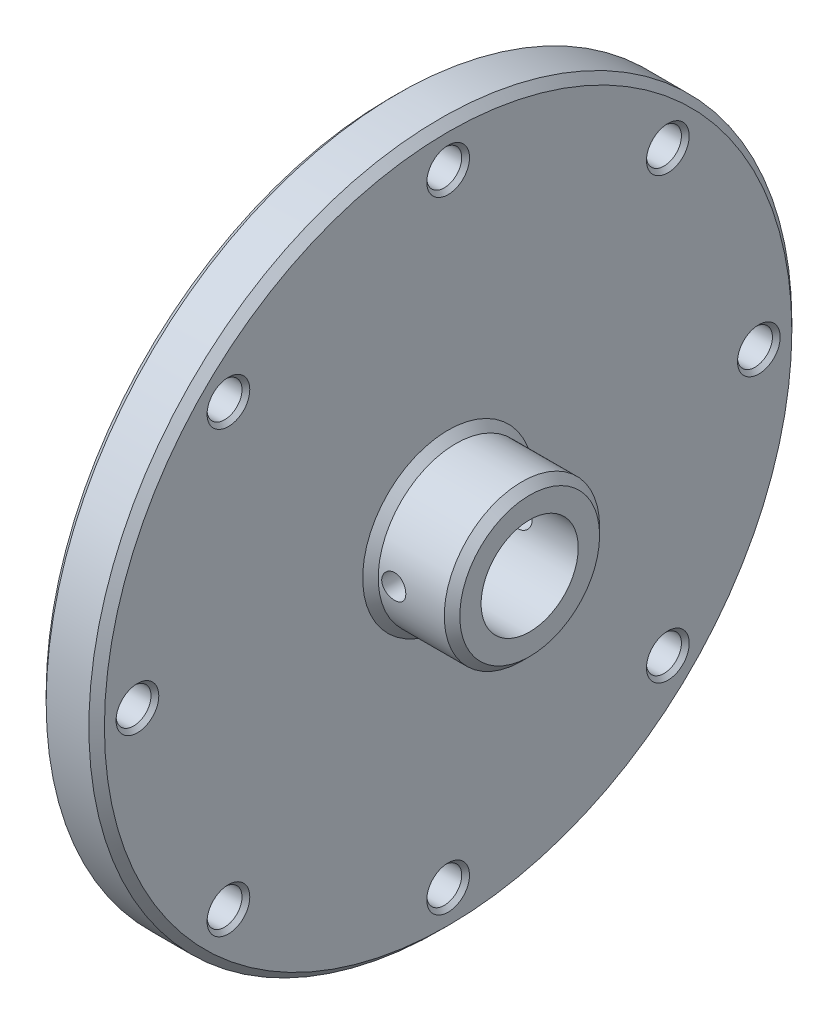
from build123d import *

# Parameters (mm, degrees)
CHANFREIN1_SIZE                           = 2
ENL_V_MAT_EXTRU_1_DEPTH                   = 132.121127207
ENL_V_MAT_EXTRU_1_DEPTH_BACK              = 132.121127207
ESQUISSE2_R                               = 3.1
ESQUISSE3_R                               = 4.5
ENL_V_MAT_EXTRU_2_DEPTH                   = 130.697725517
CHANFREIN2_SIZE                           = 1
R_P_TITION_CIRCULAIRE1_COUNT              = 8
CHANFREIN2_OF_R_P_TITION_CIRCULAIRE1_SIZE = 1


with BuildPart() as part:
    # Esquisse1 → R_volution1 (revolve)
    with BuildSketch(Plane.XY, mode=Mode.PRIVATE) as r_volution1_sk:
        Polygon((-4.716878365, 0), (2.5, 12.5), (28.5, 12.5), (28.5, 20), (7.5, 20), (7.5, 90.5), (-7.5, 90.5), (-7.5, 0), align=None)
    revolve(r_volution1_sk.sketch.rotate(Axis((37.833317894, 0, 0), (-1, 0, 0)), 90), axis=Axis((37.833317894, 0, 0), (-1, 0, 0)))

    # Chanfrein1
    chanfrein1_edges = [part.edges().sort_by_distance(p)[0] for p in [
        (-7.5, 0, 90.5),
        (7.5, 0, 90.5),
        (7.5, 0, 20),
        (28.5, 0, 20),
    ]]
    chamfer(chanfrein1_edges, length=CHANFREIN1_SIZE)

    # Esquisse2 → Enl_v. mat.-Extru.1 (cut, two sides: drawn at the far end of the back side and taken through both)
    with BuildSketch(Plane.XY.offset(-ENL_V_MAT_EXTRU_1_DEPTH_BACK)):
        with Locations((13.5, 0)):
            Circle(ESQUISSE2_R)
    extrude(amount=ENL_V_MAT_EXTRU_1_DEPTH + ENL_V_MAT_EXTRU_1_DEPTH_BACK, mode=Mode.SUBTRACT)

    # Esquisse3 → Enl_v. mat.-Extru.2 (cut, through all)
    with BuildSketch(Plane(origin=(7.5, 0, 0), x_dir=(0, 0, -1), z_dir=(1, 0, 0))):
        with Locations((0, 80)):
            Circle(ESQUISSE3_R)
    enl_v_mat_extru_2 = extrude(amount=-ENL_V_MAT_EXTRU_2_DEPTH, mode=Mode.SUBTRACT)

    # Chanfrein2
    chanfrein2_edges = [part.edges().sort_by_distance(p)[0] for p in [
        (7.5, 80, 4.5),
    ]]
    chamfer(chanfrein2_edges, length=CHANFREIN2_SIZE)

    # R_p_tition circulaire1: Enl_v. mat.-Extru.2 ×8 about axis
    r_p_tition_circulaire1_axis = Axis((0, 0, 0), (1, 0, 0))
    for i in range(1, R_P_TITION_CIRCULAIRE1_COUNT):
        add(enl_v_mat_extru_2.rotate(r_p_tition_circulaire1_axis, i * 360 / R_P_TITION_CIRCULAIRE1_COUNT), mode=Mode.SUBTRACT)

    # Chanfrein2 of R_p_tition circulaire1
    chanfrein2_of_r_p_tition_circulaire1_edges = [part.edges().sort_by_distance(p)[0] for p in [
        (7.5, 53.38656198, 59.75052301),
        (7.5, -4.5, 80),
        (7.5, -59.75052301, 53.38656198),
        (7.5, -80, -4.5),
        (7.5, -53.38656198, -59.75052301),
        (7.5, 4.5, -80),
        (7.5, 59.75052301, -53.38656198),
    ]]
    chamfer(chanfrein2_of_r_p_tition_circulaire1_edges, length=CHANFREIN2_OF_R_P_TITION_CIRCULAIRE1_SIZE)


solid = part.part
